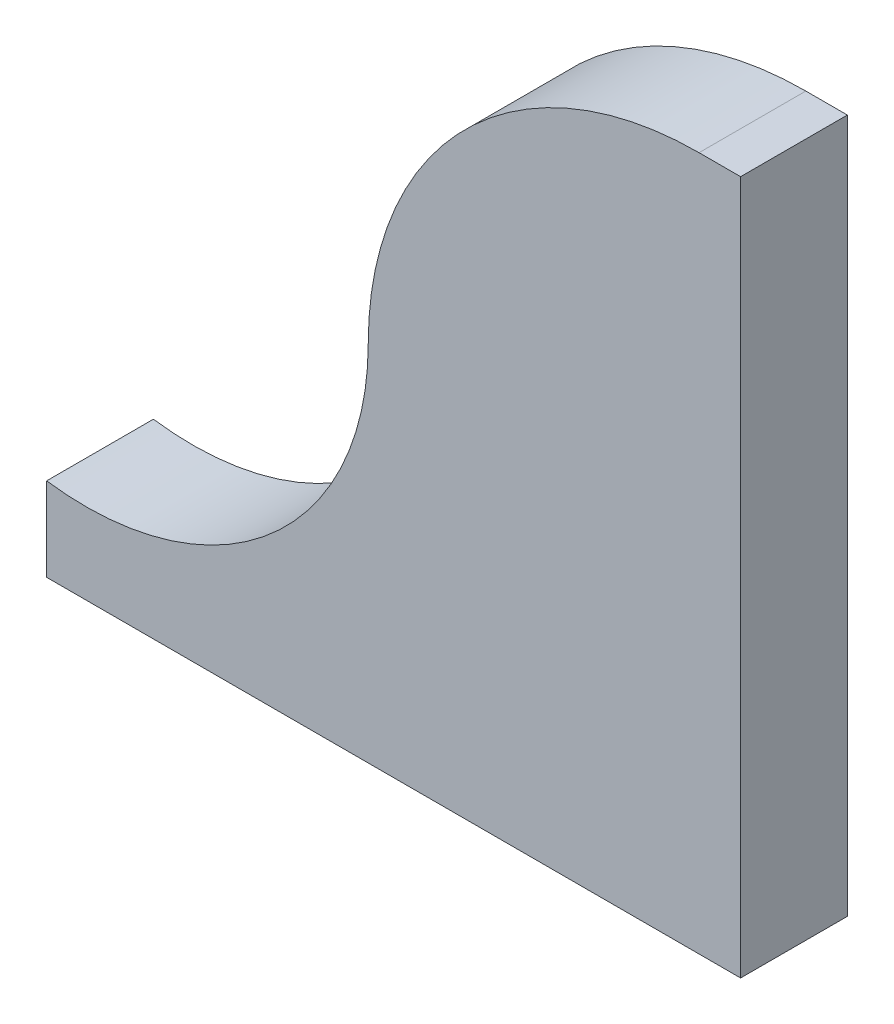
from build123d import *

# Parameters (mm, degrees)
EXTRUDE1_DEPTH = 10


with BuildPart() as part:
    # Sketch1 → Extrude1 (new body)
    with BuildSketch(Plane.XY):
        with BuildLine():
            Line((-65, 0), (0, 0))
            Line((0, 0), (0, 65))
            Line((0, 65), (-3.891900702, 65))
            ThreePointArc((-3.891900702, 65), (-25.801857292, 55.92459883), (-34.877258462, 34.01464224))
            ThreePointArc((-34.877258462, 34.01464224), (-43.971805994, 14.05746496), (-65, 7.827314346))
            Line((-65, 7.827314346), (-65, 0))
        make_face()
    extrude(amount=EXTRUDE1_DEPTH)


solid = part.part
